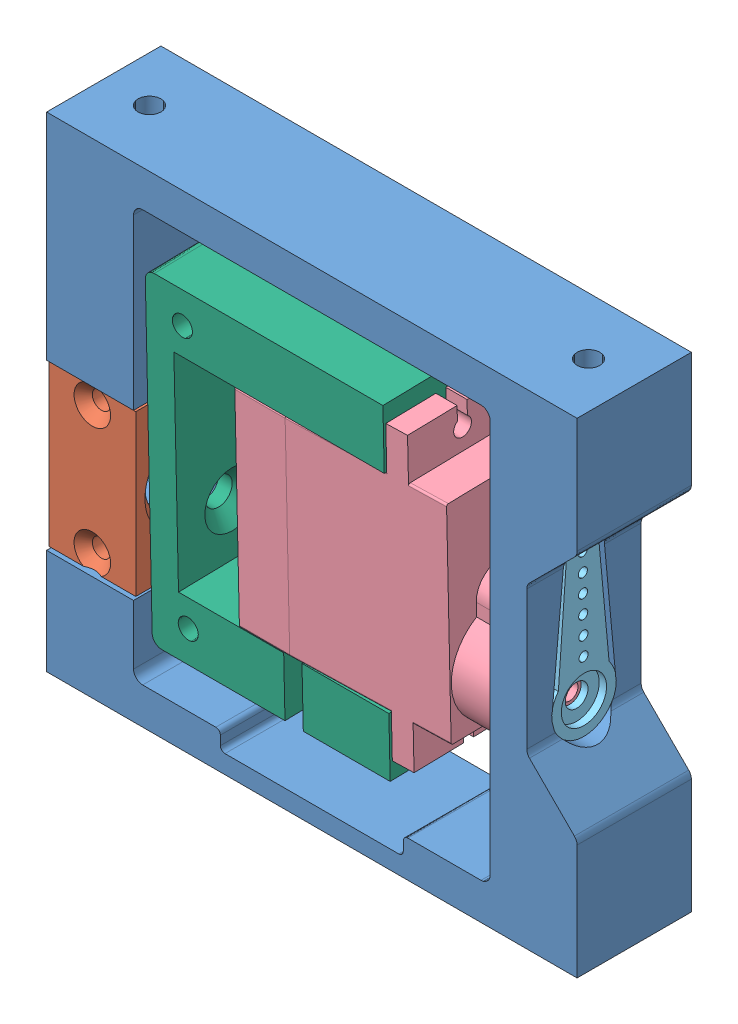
SolidWorks assembly Фронтальная камера в сборе.SLDASM, configuration По умолчанию (file format 10000). Lengths in mm.
Overall size (58 53 32.05).
6 component instances, 6 part files, 12 mates.
Components (placement in the parent):
- корпус камеры серво-1: корпус камеры серво.SLDPRT [По умолчанию] at origin size (58 53 12.5)
- держатель подшипника сервокамеры-1: держатель подшипника сервокамеры.SLDPRT [По умолчанию] at (-24.25 -6 6.25) x (0 1 0) z (1 0 0) size (17.5 6.19 9.5)
- камера-1: камера.SLDPRT [По умолчанию] at (-13.2482 -11.6267 -2.5813) x (1 0 0) z (0 -0.022058 0.999757) size (25 24 16.4)
- Tower Pro 9g Micro Servo SG90-2: Tower Pro 9g Micro Servo SG90.SLDPRT [Default] at (8.34 -4.5953 6.281) x (0 0.999757 0.022058) z (0 0.022058 -0.999757) size (36.67 29.95 12.59)
- SG90 plastic Horn-1: SG90 plastic Horn.SLDPRT [Default] at (21.5 -6 6.25) x (0 0.999949 0.01005) z (0 0.01005 -0.999949) size (19.4 4 7.07)
- поворотная платформа камеры-1: поворотная платформа камеры.SLDPRT [По умолчанию] at (0.84 -0.0044 -2.3248) x (1 0 0) z (0 -0.022058 0.999757) size (37 36 15)
Mates (geometry in assembly coordinates):
- Концентричный1: concentric aligned: cylinder of корпус камеры серво-1 through (-24.25 1 0) axis (0 0 1) radius 0.75; cylinder of держатель подшипника сервокамеры-1 through (-24.25 1 6.25) axis (0 0 1) radius 1
- Концентричный2: concentric aligned: cylinder of корпус камеры серво-1 through (-24.25 -13 0) axis (0 0 1) radius 0.75; cylinder of держатель подшипника сервокамеры-1 through (-24.25 -13 6.25) axis (0 0 1) radius 1
- Совпадение1: coincident anti-aligned: plane of корпус камеры серво-1 through (-0.4458 3 6.25) normal (0 0 1); plane of держатель подшипника сервокамеры-1 through (-29 -14.75 6.25) normal (0 0 -1)
- Концентричный3: concentric aligned: cylinder of корпус камеры серво-1 through (-29 -6 6.25) axis (1 0 0) radius 3.5; cylinder of Tower Pro 9g Micro Servo SG90-2 through (18 -6 6.25) axis (1 0 0) radius 0.9
- Концентричный4: concentric aligned: cylinder of корпус камеры серво-1 through (-29 -6 6.25) axis (1 0 0) radius 3.5; cylinder of SG90 plastic Horn-1 through (76.5 -6 6.25) axis (1 0 0) radius 2.375
- Совпадение2: coincident anti-aligned: plane of корпус камеры серво-1 through (21.5 -22.5 0) normal (1 0 0); plane of SG90 plastic Horn-1 through (21.5 -6 6.25) normal (-1 0 0)
- Параллельность1: parallel anti-aligned: plane of корпус камеры серво-1 through (-1.4067 8.2043 4.0595) normal (0 -0.092857 0.995679); plane of SG90 plastic Horn-1 through (37.4538 -5.7264 3.3158) normal (0 0.092857 -0.995679)
- Совпадение4: coincident anti-aligned: plane of Tower Pro 9g Micro Servo SG90-2 through (21.95 -6 6.25) normal (1 0 0); plane of SG90 plastic Horn-1 through (21.95 -4.7551 6.2625) normal (-1 0 0)
- Совпадение8: coincident anti-aligned: plane of Tower Pro 9g Micro Servo SG90-2 through (8.34 11.4396 0.3382) normal (0 0.999757 0.022058); plane of поворотная платформа камеры-1 through (-7.96 11.1619 12.9252) normal (0 -0.999757 -0.022058)
- Совпадение10: coincident anti-aligned: plane of Tower Pro 9g Micro Servo SG90-2 through (8.34 -16.2236 -0.2721) normal (-1 0 0); plane of поворотная платформа камеры-1 through (8.34 -18.3309 12.2745) normal (1 0 0)
- Совпадение11: coincident aligned: plane of Tower Pro 9g Micro Servo SG90-2 through (8.34 -4.7342 12.5745) normal (0 -0.022058 0.999757); plane of поворотная платформа камеры-1 through (0.84 -0.3353 12.6715) normal (0 -0.022058 0.999757)
- Совпадение12: coincident anti-aligned: plane of камера-1 through (-13.2482 -11.6267 -2.5813) normal (0 -0.022058 0.999757); plane of поворотная платформа камеры-1 through (0.84 -0.0044 -2.3248) normal (0 0.022058 -0.999757)
